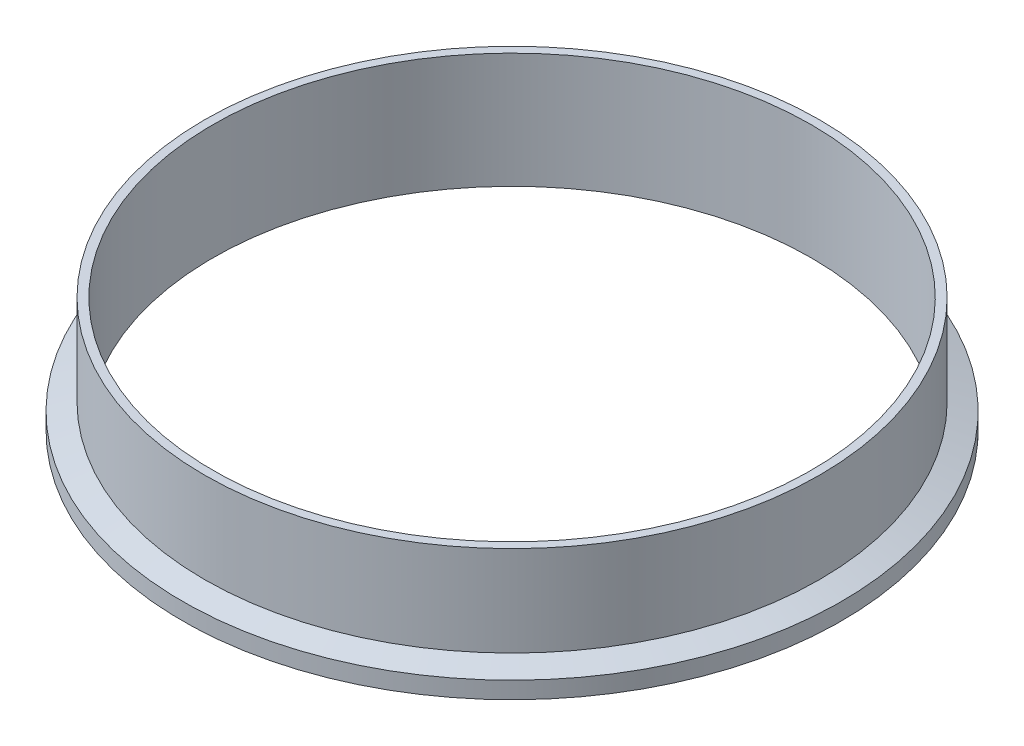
ISO-10303-21;
HEADER;
FILE_DESCRIPTION(('STEP AP214'),'2;1');
FILE_NAME('part.step','',(''),(''),'','','');
FILE_SCHEMA(('AUTOMOTIVE_DESIGN { 1 0 10303 214 1 1 1 1 }'));
ENDSEC;
DATA;
#1=APPLICATION_CONTEXT('core data for automotive mechanical design processes');
#2=APPLICATION_PROTOCOL_DEFINITION('international standard','automotive_design',2000,#1);
#3=PRODUCT_CONTEXT('',#1,'mechanical');
#4=PRODUCT('Part','Part','',(#3));
#5=PRODUCT_RELATED_PRODUCT_CATEGORY('part','',(#4));
#6=PRODUCT_DEFINITION_FORMATION('','',#4);
#7=PRODUCT_DEFINITION_CONTEXT('part definition',#1,'design');
#8=PRODUCT_DEFINITION('design','',#6,#7);
#9=PRODUCT_DEFINITION_SHAPE('','',#8);
#10=(LENGTH_UNIT() NAMED_UNIT(*) SI_UNIT(.MILLI.,.METRE.));
#11=(NAMED_UNIT(*) PLANE_ANGLE_UNIT() SI_UNIT($,.RADIAN.));
#12=(NAMED_UNIT(*) SI_UNIT($,.STERADIAN.) SOLID_ANGLE_UNIT());
#13=UNCERTAINTY_MEASURE_WITH_UNIT(LENGTH_MEASURE(1.E-05),#10,'distance_accuracy_value','');
#14=(GEOMETRIC_REPRESENTATION_CONTEXT(3) GLOBAL_UNCERTAINTY_ASSIGNED_CONTEXT((#13)) GLOBAL_UNIT_ASSIGNED_CONTEXT((#10,
#11,#12)) REPRESENTATION_CONTEXT('',''));
#15=CARTESIAN_POINT('',(0.,0.,0.));
#16=DIRECTION('',(0.,0.,1.));
#17=DIRECTION('',(1.,0.,0.));
#18=AXIS2_PLACEMENT_3D('',#15,#16,#17);
#19=CARTESIAN_POINT('',(0.,0.7874,0.));
#20=DIRECTION('',(0.,-1.,0.));
#21=DIRECTION('',(0.,0.,-1.));
#22=AXIS2_PLACEMENT_3D('',#19,#20,#21);
#23=TOROIDAL_SURFACE('',#22,105.399208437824,0.787400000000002);
#24=CARTESIAN_POINT('',(0.,0.,0.));
#25=DIRECTION('',(0.,-1.,0.));
#26=DIRECTION('',(0.,0.,-1.));
#27=AXIS2_PLACEMENT_3D('',#24,#25,#26);
#28=CIRCLE('',#27,105.399208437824);
#29=CARTESIAN_POINT('',(0.,0.,-105.399208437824));
#30=VERTEX_POINT('',#29);
#31=EDGE_CURVE('E67',#30,#30,#28,.T.);
#32=ORIENTED_EDGE('',*,*,#31,.T.);
#33=EDGE_LOOP('',(#32));
#34=FACE_BOUND('',#33,.T.);
#35=CARTESIAN_POINT('',(0.,0.474458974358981,0.));
#36=DIRECTION('',(0.,-1.,0.));
#37=DIRECTION('',(0.,0.,-1.));
#38=AXIS2_PLACEMENT_3D('',#35,#36,#37);
#39=CIRCLE('',#38,104.676666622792);
#40=CARTESIAN_POINT('',(0.,0.474458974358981,-104.676666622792));
#41=VERTEX_POINT('',#40);
#42=EDGE_CURVE('E10',#41,#41,#39,.T.);
#43=ORIENTED_EDGE('',*,*,#42,.F.);
#44=EDGE_LOOP('',(#43));
#45=FACE_BOUND('',#44,.T.);
#46=ADVANCED_FACE('F33',(#34,#45),#23,.T.);
#47=CARTESIAN_POINT('',(0.,0.,0.));
#48=DIRECTION('',(0.,-1.,0.));
#49=DIRECTION('',(0.,0.,-1.));
#50=AXIS2_PLACEMENT_3D('',#47,#48,#49);
#51=TOROIDAL_SURFACE('',#50,103.5812,1.1938);
#52=CARTESIAN_POINT('',(0.,0.474458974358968,0.));
#53=DIRECTION('',(0.,-1.,0.));
#54=DIRECTION('',(0.,0.,-1.));
#55=AXIS2_PLACEMENT_3D('',#52,#53,#54);
#56=CIRCLE('',#55,102.485733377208);
#57=CARTESIAN_POINT('',(0.,0.474458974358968,-102.485733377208));
#58=VERTEX_POINT('',#57);
#59=EDGE_CURVE('E39',#58,#58,#56,.T.);
#60=ORIENTED_EDGE('',*,*,#59,.F.);
#61=EDGE_LOOP('',(#60));
#62=FACE_BOUND('',#61,.T.);
#63=ORIENTED_EDGE('',*,*,#42,.T.);
#64=EDGE_LOOP('',(#63));
#65=FACE_BOUND('',#64,.T.);
#66=ADVANCED_FACE('F115',(#62,#65),#51,.F.);
#67=CARTESIAN_POINT('',(0.,0.7874,0.));
#68=DIRECTION('',(0.,-1.,0.));
#69=DIRECTION('',(0.,0.,-1.));
#70=AXIS2_PLACEMENT_3D('',#67,#68,#69);
#71=TOROIDAL_SURFACE('',#70,101.763191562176,0.787399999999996);
#72=ORIENTED_EDGE('',*,*,#59,.T.);
#73=EDGE_LOOP('',(#72));
#74=FACE_BOUND('',#73,.T.);
#75=CARTESIAN_POINT('',(0.,0.,0.));
#76=DIRECTION('',(0.,-1.,0.));
#77=DIRECTION('',(0.,0.,-1.));
#78=AXIS2_PLACEMENT_3D('',#75,#76,#77);
#79=CIRCLE('',#78,101.763191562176);
#80=CARTESIAN_POINT('',(0.,0.,-101.763191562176));
#81=VERTEX_POINT('',#80);
#82=EDGE_CURVE('E43',#81,#81,#79,.T.);
#83=ORIENTED_EDGE('',*,*,#82,.F.);
#84=EDGE_LOOP('',(#83));
#85=FACE_BOUND('',#84,.T.);
#86=ADVANCED_FACE('F111',(#74,#85),#71,.T.);
#87=CARTESIAN_POINT('',(0.,0.,0.));
#88=DIRECTION('',(0.,1.,0.));
#89=DIRECTION('',(0.,0.,1.));
#90=AXIS2_PLACEMENT_3D('',#87,#88,#89);
#91=PLANE('',#90);
#92=CARTESIAN_POINT('',(0.,0.,0.));
#93=DIRECTION('',(0.,-1.,0.));
#94=DIRECTION('',(0.,0.,-1.));
#95=AXIS2_PLACEMENT_3D('',#92,#93,#94);
#96=CIRCLE('',#95,98.8314);
#97=CARTESIAN_POINT('',(0.,0.,-98.8314));
#98=VERTEX_POINT('',#97);
#99=EDGE_CURVE('E47',#98,#98,#96,.T.);
#100=ORIENTED_EDGE('',*,*,#99,.F.);
#101=EDGE_LOOP('',(#100));
#102=FACE_BOUND('',#101,.T.);
#103=ORIENTED_EDGE('',*,*,#82,.T.);
#104=EDGE_LOOP('',(#103));
#105=FACE_BOUND('',#104,.T.);
#106=ADVANCED_FACE('F105',(#102,#105),#91,.F.);
#107=CARTESIAN_POINT('',(0.,0.,0.));
#108=DIRECTION('',(0.,-1.,0.));
#109=DIRECTION('',(0.,0.,-1.));
#110=AXIS2_PLACEMENT_3D('',#107,#108,#109);
#111=CYLINDRICAL_SURFACE('',#110,98.8314);
#112=ORIENTED_EDGE('',*,*,#99,.T.);
#113=EDGE_LOOP('',(#112));
#114=FACE_BOUND('',#113,.T.);
#115=CARTESIAN_POINT('',(0.,38.1,0.));
#116=DIRECTION('',(0.,-1.,0.));
#117=DIRECTION('',(0.,0.,-1.));
#118=AXIS2_PLACEMENT_3D('',#115,#116,#117);
#119=CIRCLE('',#118,98.8314);
#120=CARTESIAN_POINT('',(0.,38.1,-98.8314));
#121=VERTEX_POINT('',#120);
#122=EDGE_CURVE('E52',#121,#121,#119,.T.);
#123=ORIENTED_EDGE('',*,*,#122,.F.);
#124=EDGE_LOOP('',(#123));
#125=FACE_BOUND('',#124,.T.);
#126=ADVANCED_FACE('F100',(#114,#125),#111,.F.);
#127=CARTESIAN_POINT('',(0.,38.1,0.));
#128=DIRECTION('',(0.,-1.,0.));
#129=DIRECTION('',(0.,0.,-1.));
#130=AXIS2_PLACEMENT_3D('',#127,#128,#129);
#131=PLANE('',#130);
#132=CARTESIAN_POINT('',(0.,38.1,0.));
#133=DIRECTION('',(0.,-1.,0.));
#134=DIRECTION('',(0.,0.,-1.));
#135=AXIS2_PLACEMENT_3D('',#132,#133,#134);
#136=CIRCLE('',#135,101.6);
#137=CARTESIAN_POINT('',(0.,38.1,-101.6));
#138=VERTEX_POINT('',#137);
#139=EDGE_CURVE('E55',#138,#138,#136,.T.);
#140=ORIENTED_EDGE('',*,*,#139,.F.);
#141=EDGE_LOOP('',(#140));
#142=FACE_BOUND('',#141,.T.);
#143=ORIENTED_EDGE('',*,*,#122,.T.);
#144=EDGE_LOOP('',(#143));
#145=FACE_BOUND('',#144,.T.);
#146=ADVANCED_FACE('F94',(#142,#145),#131,.F.);
#147=CARTESIAN_POINT('',(0.,0.,0.));
#148=DIRECTION('',(0.,-1.,0.));
#149=DIRECTION('',(0.,0.,-1.));
#150=AXIS2_PLACEMENT_3D('',#147,#148,#149);
#151=CYLINDRICAL_SURFACE('',#150,101.6);
#152=CARTESIAN_POINT('',(0.,8.22278052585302,0.));
#153=DIRECTION('',(0.,-1.,0.));
#154=DIRECTION('',(0.,0.,-1.));
#155=AXIS2_PLACEMENT_3D('',#152,#153,#154);
#156=CIRCLE('',#155,101.6);
#157=CARTESIAN_POINT('',(0.,8.22278052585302,-101.6));
#158=VERTEX_POINT('',#157);
#159=EDGE_CURVE('E58',#158,#158,#156,.T.);
#160=ORIENTED_EDGE('',*,*,#159,.F.);
#161=EDGE_LOOP('',(#160));
#162=FACE_BOUND('',#161,.T.);
#163=ORIENTED_EDGE('',*,*,#139,.T.);
#164=EDGE_LOOP('',(#163));
#165=FACE_BOUND('',#164,.T.);
#166=ADVANCED_FACE('F88',(#162,#165),#151,.T.);
#167=CARTESIAN_POINT('',(0.,8.22278052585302,0.));
#168=DIRECTION('',(0.,-1.,0.));
#169=DIRECTION('',(0.,0.,-1.));
#170=AXIS2_PLACEMENT_3D('',#167,#168,#169);
#171=CONICAL_SURFACE('',#170,101.6,1.22173047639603);
#172=CARTESIAN_POINT('',(0.,5.588,0.));
#173=DIRECTION('',(0.,-1.,0.));
#174=DIRECTION('',(0.,0.,-1.));
#175=AXIS2_PLACEMENT_3D('',#172,#173,#174);
#176=CIRCLE('',#175,108.839);
#177=CARTESIAN_POINT('',(0.,5.588,-108.839));
#178=VERTEX_POINT('',#177);
#179=EDGE_CURVE('E61',#178,#178,#176,.T.);
#180=ORIENTED_EDGE('',*,*,#179,.F.);
#181=EDGE_LOOP('',(#180));
#182=FACE_BOUND('',#181,.T.);
#183=ORIENTED_EDGE('',*,*,#159,.T.);
#184=EDGE_LOOP('',(#183));
#185=FACE_BOUND('',#184,.T.);
#186=ADVANCED_FACE('F82',(#182,#185),#171,.T.);
#187=CARTESIAN_POINT('',(0.,0.,0.));
#188=DIRECTION('',(0.,-1.,0.));
#189=DIRECTION('',(0.,0.,-1.));
#190=AXIS2_PLACEMENT_3D('',#187,#188,#189);
#191=CYLINDRICAL_SURFACE('',#190,108.839);
#192=CARTESIAN_POINT('',(0.,0.,0.));
#193=DIRECTION('',(0.,-1.,0.));
#194=DIRECTION('',(0.,0.,-1.));
#195=AXIS2_PLACEMENT_3D('',#192,#193,#194);
#196=CIRCLE('',#195,108.839);
#197=CARTESIAN_POINT('',(0.,0.,-108.839));
#198=VERTEX_POINT('',#197);
#199=EDGE_CURVE('E64',#198,#198,#196,.T.);
#200=ORIENTED_EDGE('',*,*,#199,.F.);
#201=EDGE_LOOP('',(#200));
#202=FACE_BOUND('',#201,.T.);
#203=ORIENTED_EDGE('',*,*,#179,.T.);
#204=EDGE_LOOP('',(#203));
#205=FACE_BOUND('',#204,.T.);
#206=ADVANCED_FACE('F76',(#202,#205),#191,.T.);
#207=CARTESIAN_POINT('',(0.,0.,0.));
#208=DIRECTION('',(0.,1.,0.));
#209=DIRECTION('',(0.,0.,1.));
#210=AXIS2_PLACEMENT_3D('',#207,#208,#209);
#211=PLANE('',#210);
#212=ORIENTED_EDGE('',*,*,#31,.F.);
#213=EDGE_LOOP('',(#212));
#214=FACE_BOUND('',#213,.T.);
#215=ORIENTED_EDGE('',*,*,#199,.T.);
#216=EDGE_LOOP('',(#215));
#217=FACE_BOUND('',#216,.T.);
#218=ADVANCED_FACE('F73',(#214,#217),#211,.F.);
#219=CLOSED_SHELL('',(#46,#66,#86,#106,#126,#146,#166,#186,#206,#218));
#220=MANIFOLD_SOLID_BREP('B2',#219);
#221=ADVANCED_BREP_SHAPE_REPRESENTATION('',(#18,#220),#14);
#222=SHAPE_DEFINITION_REPRESENTATION(#9,#221);
ENDSEC;
END-ISO-10303-21;
